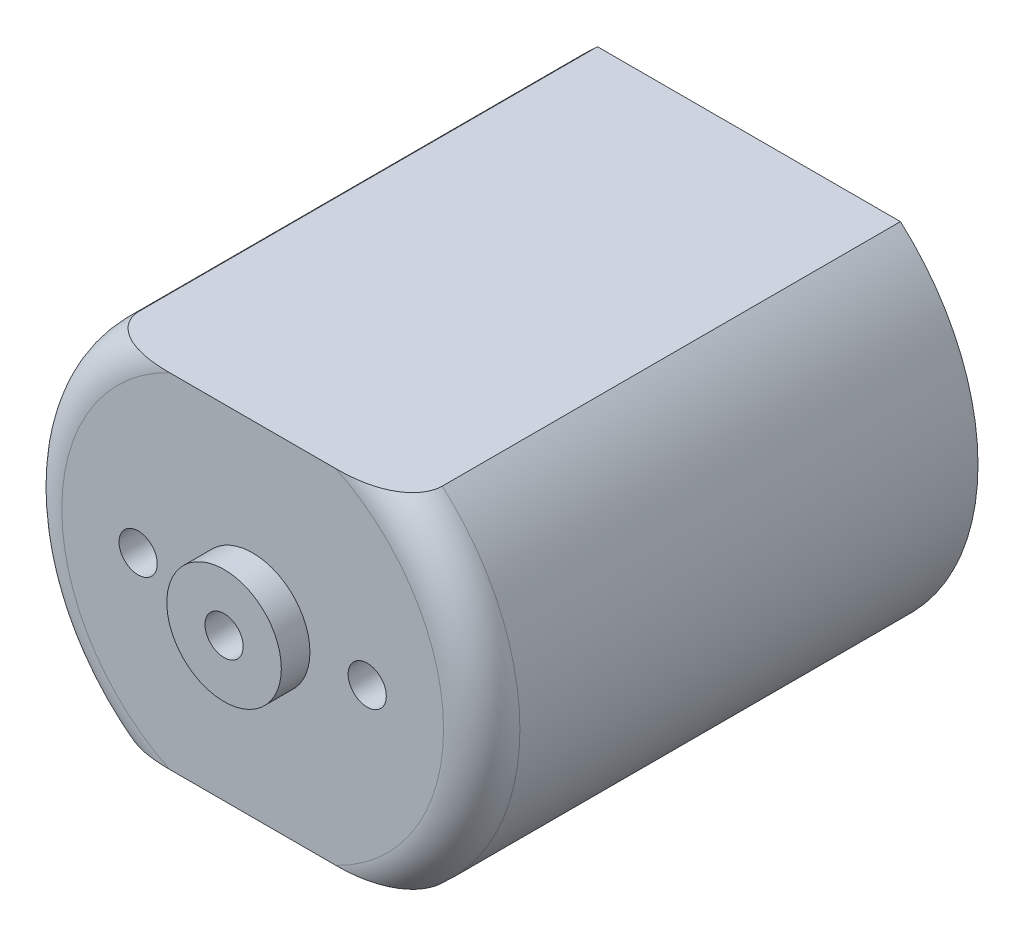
ISO-10303-21;
HEADER;
FILE_DESCRIPTION(('STEP AP214'),'2;1');
FILE_NAME('part.step','',(''),(''),'','','');
FILE_SCHEMA(('AUTOMOTIVE_DESIGN { 1 0 10303 214 1 1 1 1 }'));
ENDSEC;
DATA;
#1=APPLICATION_CONTEXT('core data for automotive mechanical design processes');
#2=APPLICATION_PROTOCOL_DEFINITION('international standard','automotive_design',2000,#1);
#3=PRODUCT_CONTEXT('',#1,'mechanical');
#4=PRODUCT('Part','Part','',(#3));
#5=PRODUCT_RELATED_PRODUCT_CATEGORY('part','',(#4));
#6=PRODUCT_DEFINITION_FORMATION('','',#4);
#7=PRODUCT_DEFINITION_CONTEXT('part definition',#1,'design');
#8=PRODUCT_DEFINITION('design','',#6,#7);
#9=PRODUCT_DEFINITION_SHAPE('','',#8);
#10=(LENGTH_UNIT() NAMED_UNIT(*) SI_UNIT(.MILLI.,.METRE.));
#11=(NAMED_UNIT(*) PLANE_ANGLE_UNIT() SI_UNIT($,.RADIAN.));
#12=(NAMED_UNIT(*) SI_UNIT($,.STERADIAN.) SOLID_ANGLE_UNIT());
#13=UNCERTAINTY_MEASURE_WITH_UNIT(LENGTH_MEASURE(1.E-05),#10,'distance_accuracy_value','');
#14=(GEOMETRIC_REPRESENTATION_CONTEXT(3) GLOBAL_UNCERTAINTY_ASSIGNED_CONTEXT((#13)) GLOBAL_UNIT_ASSIGNED_CONTEXT((#10,
#11,#12)) REPRESENTATION_CONTEXT('',''));
#15=CARTESIAN_POINT('',(0.,0.,0.));
#16=DIRECTION('',(0.,0.,1.));
#17=DIRECTION('',(1.,0.,0.));
#18=AXIS2_PLACEMENT_3D('',#15,#16,#17);
#19=CARTESIAN_POINT('',(0.,0.,-13.));
#20=DIRECTION('',(0.,0.,1.));
#21=DIRECTION('',(1.,0.,0.));
#22=AXIS2_PLACEMENT_3D('',#19,#20,#21);
#23=PLANE('',#22);
#24=DIRECTION('',(1.,0.,0.));
#25=VECTOR('',#24,1.);
#26=CARTESIAN_POINT('',(12.0000000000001,9.00000000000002,-13.));
#27=LINE('',#26,#25);
#28=CARTESIAN_POINT('',(-7.93725393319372,9.00000000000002,-13.));
#29=VERTEX_POINT('',#28);
#30=CARTESIAN_POINT('',(7.93725393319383,9.00000000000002,-13.));
#31=VERTEX_POINT('',#30);
#32=EDGE_CURVE('E93',#29,#31,#27,.T.);
#33=ORIENTED_EDGE('',*,*,#32,.T.);
#34=CARTESIAN_POINT('',(0.,0.,-13.));
#35=DIRECTION('',(0.,0.,1.));
#36=DIRECTION('',(1.,0.,0.));
#37=AXIS2_PLACEMENT_3D('',#34,#35,#36);
#38=CIRCLE('',#37,12.);
#39=CARTESIAN_POINT('',(7.93725393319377,-9.00000000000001,-13.));
#40=VERTEX_POINT('',#39);
#41=EDGE_CURVE('E88',#40,#31,#38,.T.);
#42=ORIENTED_EDGE('',*,*,#41,.F.);
#43=DIRECTION('',(-1.,0.,0.));
#44=VECTOR('',#43,1.);
#45=CARTESIAN_POINT('',(12.,-9.00000000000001,-13.));
#46=LINE('',#45,#44);
#47=CARTESIAN_POINT('',(-7.93725393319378,-9.00000000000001,-13.));
#48=VERTEX_POINT('',#47);
#49=EDGE_CURVE('E92',#40,#48,#46,.T.);
#50=ORIENTED_EDGE('',*,*,#49,.T.);
#51=EDGE_CURVE('E98',#29,#48,#38,.T.);
#52=ORIENTED_EDGE('',*,*,#51,.F.);
#53=EDGE_LOOP('',(#33,#42,#50,#52));
#54=FACE_BOUND('',#53,.T.);
#55=CARTESIAN_POINT('',(0.,0.,-13.));
#56=DIRECTION('',(0.,0.,1.));
#57=DIRECTION('',(1.,0.,0.));
#58=AXIS2_PLACEMENT_3D('',#55,#56,#57);
#59=CIRCLE('',#58,3.);
#60=CARTESIAN_POINT('',(3.,0.,-13.));
#61=VERTEX_POINT('',#60);
#62=EDGE_CURVE('E11',#61,#61,#59,.F.);
#63=ORIENTED_EDGE('',*,*,#62,.F.);
#64=EDGE_LOOP('',(#63));
#65=FACE_BOUND('',#64,.T.);
#66=ADVANCED_FACE('F33',(#54,#65),#23,.F.);
#67=CARTESIAN_POINT('',(0.,0.,13.));
#68=DIRECTION('',(0.,0.,1.));
#69=DIRECTION('',(1.,0.,0.));
#70=AXIS2_PLACEMENT_3D('',#67,#68,#69);
#71=PLANE('',#70);
#72=CARTESIAN_POINT('',(-6.00000000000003,0.,13.));
#73=DIRECTION('',(0.,0.,1.));
#74=DIRECTION('',(-1.,0.,0.));
#75=AXIS2_PLACEMENT_3D('',#72,#73,#74);
#76=CIRCLE('',#75,1.);
#77=CARTESIAN_POINT('',(-7.00000000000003,0.,13.));
#78=VERTEX_POINT('',#77);
#79=EDGE_CURVE('E199',#78,#78,#76,.T.);
#80=ORIENTED_EDGE('',*,*,#79,.F.);
#81=EDGE_LOOP('',(#80));
#82=FACE_BOUND('',#81,.T.);
#83=CARTESIAN_POINT('',(5.99999999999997,0.,13.));
#84=DIRECTION('',(0.,0.,1.));
#85=DIRECTION('',(1.,0.,0.));
#86=AXIS2_PLACEMENT_3D('',#83,#84,#85);
#87=CIRCLE('',#86,1.);
#88=CARTESIAN_POINT('',(6.99999999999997,0.,13.));
#89=VERTEX_POINT('',#88);
#90=EDGE_CURVE('E203',#89,#89,#87,.T.);
#91=ORIENTED_EDGE('',*,*,#90,.F.);
#92=EDGE_LOOP('',(#91));
#93=FACE_BOUND('',#92,.T.);
#94=CARTESIAN_POINT('',(0.,0.,13.));
#95=DIRECTION('',(0.,0.,1.));
#96=DIRECTION('',(1.,0.,0.));
#97=AXIS2_PLACEMENT_3D('',#94,#95,#96);
#98=CIRCLE('',#97,10.);
#99=CARTESIAN_POINT('',(4.35889894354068,-9.00000000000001,13.));
#100=VERTEX_POINT('',#99);
#101=CARTESIAN_POINT('',(4.35889894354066,8.99999999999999,13.));
#102=VERTEX_POINT('',#101);
#103=EDGE_CURVE('E97',#100,#102,#98,.T.);
#104=ORIENTED_EDGE('',*,*,#103,.T.);
#105=DIRECTION('',(1.,0.,0.));
#106=VECTOR('',#105,1.);
#107=CARTESIAN_POINT('',(12.0000000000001,8.99999999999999,13.));
#108=LINE('',#107,#106);
#109=CARTESIAN_POINT('',(-4.3588989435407,8.99999999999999,13.));
#110=VERTEX_POINT('',#109);
#111=EDGE_CURVE('E56',#110,#102,#108,.T.);
#112=ORIENTED_EDGE('',*,*,#111,.F.);
#113=CARTESIAN_POINT('',(-4.35889894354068,-9.00000000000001,13.));
#114=VERTEX_POINT('',#113);
#115=EDGE_CURVE('E121',#110,#114,#98,.T.);
#116=ORIENTED_EDGE('',*,*,#115,.T.);
#117=DIRECTION('',(-1.,0.,0.));
#118=VECTOR('',#117,1.);
#119=CARTESIAN_POINT('',(12.,-9.00000000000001,13.));
#120=LINE('',#119,#118);
#121=EDGE_CURVE('E48',#100,#114,#120,.T.);
#122=ORIENTED_EDGE('',*,*,#121,.F.);
#123=EDGE_LOOP('',(#104,#112,#116,#122));
#124=FACE_BOUND('',#123,.T.);
#125=CARTESIAN_POINT('',(0.,0.,13.));
#126=DIRECTION('',(0.,0.,1.));
#127=DIRECTION('',(1.,0.,0.));
#128=AXIS2_PLACEMENT_3D('',#125,#126,#127);
#129=CIRCLE('',#128,3.);
#130=CARTESIAN_POINT('',(3.,0.,13.));
#131=VERTEX_POINT('',#130);
#132=EDGE_CURVE('E208',#131,#131,#129,.T.);
#133=ORIENTED_EDGE('',*,*,#132,.F.);
#134=EDGE_LOOP('',(#133));
#135=FACE_BOUND('',#134,.T.);
#136=ADVANCED_FACE('F187',(#82,#93,#124,#135),#71,.T.);
#137=CARTESIAN_POINT('',(0.,0.,13.));
#138=DIRECTION('',(0.,0.,-1.));
#139=DIRECTION('',(-1.,0.,0.));
#140=AXIS2_PLACEMENT_3D('',#137,#138,#139);
#141=CYLINDRICAL_SURFACE('',#140,12.);
#142=DIRECTION('',(0.,0.,-1.));
#143=VECTOR('',#142,1.);
#144=CARTESIAN_POINT('',(7.93725393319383,8.99999999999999,13.));
#145=LINE('',#144,#143);
#146=CARTESIAN_POINT('',(7.93725393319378,8.99999999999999,11.));
#147=VERTEX_POINT('',#146);
#148=EDGE_CURVE('E110',#147,#31,#145,.T.);
#149=ORIENTED_EDGE('',*,*,#148,.F.);
#150=CARTESIAN_POINT('',(0.,0.,11.));
#151=DIRECTION('',(0.,0.,1.));
#152=DIRECTION('',(1.,0.,0.));
#153=AXIS2_PLACEMENT_3D('',#150,#151,#152);
#154=CIRCLE('',#153,12.);
#155=CARTESIAN_POINT('',(7.93725393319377,-9.00000000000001,11.));
#156=VERTEX_POINT('',#155);
#157=EDGE_CURVE('E109',#147,#156,#154,.F.);
#158=ORIENTED_EDGE('',*,*,#157,.T.);
#159=DIRECTION('',(0.,0.,-1.));
#160=VECTOR('',#159,1.);
#161=CARTESIAN_POINT('',(7.93725393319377,-9.00000000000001,13.));
#162=LINE('',#161,#160);
#163=EDGE_CURVE('E102',#40,#156,#162,.F.);
#164=ORIENTED_EDGE('',*,*,#163,.F.);
#165=ORIENTED_EDGE('',*,*,#41,.T.);
#166=EDGE_LOOP('',(#149,#158,#164,#165));
#167=FACE_BOUND('',#166,.T.);
#168=ADVANCED_FACE('F35',(#167),#141,.T.);
#169=CARTESIAN_POINT('',(-7.93725393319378,-9.00000000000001,11.));
#170=VERTEX_POINT('',#169);
#171=CARTESIAN_POINT('',(-7.93725393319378,9.00000000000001,11.));
#172=VERTEX_POINT('',#171);
#173=EDGE_CURVE('E124',#170,#172,#154,.F.);
#174=ORIENTED_EDGE('',*,*,#173,.T.);
#175=DIRECTION('',(0.,0.,-1.));
#176=VECTOR('',#175,1.);
#177=CARTESIAN_POINT('',(-7.93725393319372,8.99999999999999,13.));
#178=LINE('',#177,#176);
#179=EDGE_CURVE('E112',#29,#172,#178,.F.);
#180=ORIENTED_EDGE('',*,*,#179,.F.);
#181=ORIENTED_EDGE('',*,*,#51,.T.);
#182=DIRECTION('',(0.,0.,-1.));
#183=VECTOR('',#182,1.);
#184=CARTESIAN_POINT('',(-7.93725393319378,-8.99999999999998,13.));
#185=LINE('',#184,#183);
#186=EDGE_CURVE('E105',#170,#48,#185,.T.);
#187=ORIENTED_EDGE('',*,*,#186,.F.);
#188=EDGE_LOOP('',(#174,#180,#181,#187));
#189=FACE_BOUND('',#188,.T.);
#190=ADVANCED_FACE('F195',(#189),#141,.T.);
#191=CARTESIAN_POINT('',(0.,0.,11.));
#192=DIRECTION('',(0.,0.,1.));
#193=DIRECTION('',(1.,0.,0.));
#194=AXIS2_PLACEMENT_3D('',#191,#192,#193);
#195=TOROIDAL_SURFACE('',#194,10.,2.);
#196=ORIENTED_EDGE('',*,*,#115,.F.);
#197=CARTESIAN_POINT('',(0.,8.99999999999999,12.7320508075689));
#198=CARTESIAN_POINT('',(-0.166446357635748,8.99999999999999,12.732053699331));
#199=CARTESIAN_POINT('',(-0.332895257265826,9.,12.734745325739));
#200=CARTESIAN_POINT('',(-0.665633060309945,9.,12.74518762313));
#201=CARTESIAN_POINT('',(-0.831921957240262,9.,12.7529384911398));
#202=CARTESIAN_POINT('',(-1.1644046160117,9.,12.7725798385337));
#203=CARTESIAN_POINT('',(-1.33059813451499,9.,12.7844742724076));
#204=CARTESIAN_POINT('',(-1.66276754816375,9.,12.8110347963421));
#205=CARTESIAN_POINT('',(-1.82874342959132,9.,12.8257010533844));
#206=CARTESIAN_POINT('',(-2.32866263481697,9.,12.8716350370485));
#207=CARTESIAN_POINT('',(-2.66242295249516,9.,12.9046688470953));
#208=CARTESIAN_POINT('',(-3.33063349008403,9.,12.960836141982));
#209=CARTESIAN_POINT('',(-3.66508260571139,8.99999999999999,12.9839800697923));
#210=CARTESIAN_POINT('',(-4.16865262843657,8.99999999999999,12.9994679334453));
#211=CARTESIAN_POINT('',(-4.33742400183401,9.,13.0013982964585));
#212=CARTESIAN_POINT('',(-4.67497029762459,9.,12.996483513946));
#213=CARTESIAN_POINT('',(-4.84374517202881,9.,12.9896335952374));
#214=CARTESIAN_POINT('',(-5.17956621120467,8.99999999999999,12.9647163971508));
#215=CARTESIAN_POINT('',(-5.3466167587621,8.99999999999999,12.9467125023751));
#216=CARTESIAN_POINT('',(-5.67854136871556,9.,12.89672313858));
#217=CARTESIAN_POINT('',(-5.84341751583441,9.00000000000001,12.8647522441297));
#218=CARTESIAN_POINT('',(-6.15040270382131,9.00000000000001,12.7881418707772));
#219=CARTESIAN_POINT('',(-6.29296508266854,9.,12.7453612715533));
#220=CARTESIAN_POINT('',(-6.57260930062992,9.,12.643394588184));
#221=CARTESIAN_POINT('',(-6.70967893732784,9.00000000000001,12.5841740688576));
#222=CARTESIAN_POINT('',(-6.97572844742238,9.00000000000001,12.4454900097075));
#223=CARTESIAN_POINT('',(-7.10457682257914,9.,12.365768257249));
#224=CARTESIAN_POINT('',(-7.34506582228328,9.,12.1836397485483));
#225=CARTESIAN_POINT('',(-7.45677759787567,9.00000000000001,12.0813313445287));
#226=CARTESIAN_POINT('',(-7.61173645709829,9.00000000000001,11.9010388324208));
#227=CARTESIAN_POINT('',(-7.66405220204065,9.,11.8308383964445));
#228=CARTESIAN_POINT('',(-7.75695431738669,9.,11.68298457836));
#229=CARTESIAN_POINT('',(-7.79754679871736,9.00000000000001,11.6053351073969));
#230=CARTESIAN_POINT('',(-7.86464739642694,9.00000000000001,11.4433000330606));
#231=CARTESIAN_POINT('',(-7.89103215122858,9.,11.3588625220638));
#232=CARTESIAN_POINT('',(-7.92695436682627,9.,11.186470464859));
#233=CARTESIAN_POINT('',(-7.93650581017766,9.00000000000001,11.0985188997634));
#234=CARTESIAN_POINT('',(-7.93783287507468,9.00000000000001,10.9331765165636));
#235=CARTESIAN_POINT('',(-7.93161940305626,9.,10.8557954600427));
#236=CARTESIAN_POINT('',(-7.90600892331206,9.,10.7032665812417));
#237=CARTESIAN_POINT('',(-7.88661169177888,9.00000000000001,10.6281187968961));
#238=CARTESIAN_POINT('',(-7.83637641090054,9.00000000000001,10.4832771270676));
#239=CARTESIAN_POINT('',(-7.805743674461,9.,10.4135110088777));
#240=CARTESIAN_POINT('',(-7.73468118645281,9.,10.2792046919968));
#241=CARTESIAN_POINT('',(-7.69424752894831,9.00000000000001,10.2146665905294));
#242=CARTESIAN_POINT('',(-7.58437112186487,9.00000000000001,10.0624487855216));
#243=CARTESIAN_POINT('',(-7.51022785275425,9.,9.97815715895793));
#244=CARTESIAN_POINT('',(-7.3493877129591,9.,9.82255305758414));
#245=CARTESIAN_POINT('',(-7.26266234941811,9.00000000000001,9.75127089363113));
#246=CARTESIAN_POINT('',(-7.03603261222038,9.00000000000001,9.58917904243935));
#247=CARTESIAN_POINT('',(-6.89083196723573,9.,9.50581846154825));
#248=CARTESIAN_POINT('',(-6.58954981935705,9.,9.36229888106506));
#249=CARTESIAN_POINT('',(-6.43344899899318,9.00000000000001,9.30218237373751));
#250=CARTESIAN_POINT('',(-6.1342245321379,9.00000000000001,9.20713223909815));
#251=CARTESIAN_POINT('',(-5.99176040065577,9.,9.17005620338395));
#252=CARTESIAN_POINT('',(-5.70410355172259,8.99999999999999,9.10830900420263));
#253=CARTESIAN_POINT('',(-5.5589085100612,8.99999999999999,9.08364895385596));
#254=CARTESIAN_POINT('',(-5.26689906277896,9.,9.04458852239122));
#255=CARTESIAN_POINT('',(-5.12008198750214,9.,9.03020887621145));
#256=CARTESIAN_POINT('',(-4.82584012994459,9.,9.00990272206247));
#257=CARTESIAN_POINT('',(-4.67841512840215,8.99999999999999,9.00397959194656));
#258=CARTESIAN_POINT('',(-4.36286529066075,8.99999999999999,8.99857006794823));
#259=CARTESIAN_POINT('',(-4.1947263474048,9.,9.00009867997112));
#260=CARTESIAN_POINT('',(-3.85867645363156,9.,9.00975093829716));
#261=CARTESIAN_POINT('',(-3.69076549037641,9.,9.01787419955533));
#262=CARTESIAN_POINT('',(-3.18698001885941,9.,9.04906777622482));
#263=CARTESIAN_POINT('',(-2.85156732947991,9.,9.07895783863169));
#264=CARTESIAN_POINT('',(-2.34926697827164,9.,9.12583525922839));
#265=CARTESIAN_POINT('',(-2.18223841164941,9.,9.14177414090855));
#266=CARTESIAN_POINT('',(-1.84808185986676,9.,9.17256166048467));
#267=CARTESIAN_POINT('',(-1.68095388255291,9.,9.18741037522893));
#268=CARTESIAN_POINT('',(-1.34667924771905,9.,9.21433036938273));
#269=CARTESIAN_POINT('',(-1.17953287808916,9.,9.22640511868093));
#270=CARTESIAN_POINT('',(-0.84498772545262,9.,9.24640094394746));
#271=CARTESIAN_POINT('',(-0.677588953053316,8.99999999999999,9.25432218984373));
#272=CARTESIAN_POINT('',(-0.353673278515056,8.99999999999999,9.26470293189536));
#273=CARTESIAN_POINT('',(-0.197167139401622,9.,9.26748831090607));
#274=CARTESIAN_POINT('',(0.115858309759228,9.,9.26830405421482));
#275=CARTESIAN_POINT('',(0.272377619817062,9.,9.26633441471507));
#276=CARTESIAN_POINT('',(0.585397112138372,9.,9.25785065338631));
#277=CARTESIAN_POINT('',(0.7418972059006,9.,9.25133338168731));
#278=CARTESIAN_POINT('',(1.05468513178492,9.,9.2344459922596));
#279=CARTESIAN_POINT('',(1.21097295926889,9.,9.22407579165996));
#280=CARTESIAN_POINT('',(1.52404825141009,9.,9.20049108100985));
#281=CARTESIAN_POINT('',(1.68083471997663,9.,9.18726374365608));
#282=CARTESIAN_POINT('',(1.99427604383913,9.,9.15931406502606));
#283=CARTESIAN_POINT('',(2.15093089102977,9.,9.14459163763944));
#284=CARTESIAN_POINT('',(2.62080244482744,9.,9.10035040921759));
#285=CARTESIAN_POINT('',(2.93402711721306,8.99999999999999,9.07074822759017));
#286=CARTESIAN_POINT('',(3.42170521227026,8.99999999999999,9.03414088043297));
#287=CARTESIAN_POINT('',(3.59581946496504,9.,9.0229437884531));
#288=CARTESIAN_POINT('',(3.9443894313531,9.,9.00650713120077));
#289=CARTESIAN_POINT('',(4.11884521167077,9.,9.00126887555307));
#290=CARTESIAN_POINT('',(4.46738478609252,9.,8.99913723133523));
#291=CARTESIAN_POINT('',(4.64146831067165,9.,9.00222131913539));
#292=CARTESIAN_POINT('',(4.98903608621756,9.,9.01929967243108));
#293=CARTESIAN_POINT('',(5.16252059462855,8.99999999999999,9.03328844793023));
#294=CARTESIAN_POINT('',(5.54190186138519,8.99999999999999,9.07926776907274));
#295=CARTESIAN_POINT('',(5.74748282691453,9.,9.11425067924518));
#296=CARTESIAN_POINT('',(6.05126087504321,9.,9.18618675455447));
#297=CARTESIAN_POINT('',(6.15177097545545,8.99999999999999,9.21341520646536));
#298=CARTESIAN_POINT('',(6.35047200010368,8.99999999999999,9.27526323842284));
#299=CARTESIAN_POINT('',(6.44866381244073,8.99999999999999,9.30987993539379));
#300=CARTESIAN_POINT('',(6.67760627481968,8.99999999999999,9.4018810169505));
#301=CARTESIAN_POINT('',(6.80691977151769,8.99999999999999,9.46294744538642));
#302=CARTESIAN_POINT('',(7.0552378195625,8.99999999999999,9.60340858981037));
#303=CARTESIAN_POINT('',(7.17425968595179,8.99999999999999,9.68277166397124));
#304=CARTESIAN_POINT('',(7.36455614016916,8.99999999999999,9.83676673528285));
#305=CARTESIAN_POINT('',(7.43983151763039,8.99999999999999,9.90642400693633));
#306=CARTESIAN_POINT('',(7.57858868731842,8.99999999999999,10.0566961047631));
#307=CARTESIAN_POINT('',(7.64208598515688,8.99999999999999,10.1372962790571));
#308=CARTESIAN_POINT('',(7.74268923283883,8.99999999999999,10.292396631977));
#309=CARTESIAN_POINT('',(7.78251961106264,8.99999999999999,10.365120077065));
#310=CARTESIAN_POINT('',(7.84961901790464,8.99999999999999,10.516186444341));
#311=CARTESIAN_POINT('',(7.87689566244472,8.99999999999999,10.5945259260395));
#312=CARTESIAN_POINT('',(7.91708780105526,8.99999999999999,10.75535309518));
#313=CARTESIAN_POINT('',(7.92991762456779,8.99999999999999,10.8378625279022));
#314=CARTESIAN_POINT('',(7.93985142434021,8.99999999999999,11.0038227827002));
#315=CARTESIAN_POINT('',(7.93696010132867,8.99999999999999,11.0872733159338));
#316=CARTESIAN_POINT('',(7.91675510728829,8.99999999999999,11.2441717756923));
#317=CARTESIAN_POINT('',(7.90085846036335,8.99999999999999,11.3178085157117));
#318=CARTESIAN_POINT('',(7.85750648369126,8.99999999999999,11.4615660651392));
#319=CARTESIAN_POINT('',(7.83004970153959,8.99999999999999,11.5316864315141));
#320=CARTESIAN_POINT('',(7.76345524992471,8.99999999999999,11.6705117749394));
#321=CARTESIAN_POINT('',(7.72379465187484,8.99999999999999,11.7389635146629));
#322=CARTESIAN_POINT('',(7.63536443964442,8.99999999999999,11.8696579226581));
#323=CARTESIAN_POINT('',(7.586590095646,8.99999999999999,11.9318973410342));
#324=CARTESIAN_POINT('',(7.45132066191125,8.99999999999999,12.0841256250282));
#325=CARTESIAN_POINT('',(7.35935887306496,8.99999999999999,12.1692632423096));
#326=CARTESIAN_POINT('',(7.16308212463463,8.99999999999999,12.3239343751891));
#327=CARTESIAN_POINT('',(7.05873445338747,8.99999999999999,12.3934251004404));
#328=CARTESIAN_POINT('',(6.86609382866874,8.99999999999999,12.5043343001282));
#329=CARTESIAN_POINT('',(6.77938111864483,8.99999999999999,12.5485598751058));
#330=CARTESIAN_POINT('',(6.60240448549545,8.99999999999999,12.6292764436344));
#331=CARTESIAN_POINT('',(6.51213846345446,8.99999999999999,12.6657627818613));
#332=CARTESIAN_POINT('',(6.23757633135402,8.99999999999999,12.7648516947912));
#333=CARTESIAN_POINT('',(6.04950792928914,8.99999999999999,12.8170886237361));
#334=CARTESIAN_POINT('',(5.74565389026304,8.99999999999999,12.8830249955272));
#335=CARTESIAN_POINT('',(5.63123819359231,9.,12.9037732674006));
#336=CARTESIAN_POINT('',(5.40137538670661,9.,12.9385371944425));
#337=CARTESIAN_POINT('',(5.28592827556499,9.,12.9525528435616));
#338=CARTESIAN_POINT('',(4.93843430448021,9.,12.9860039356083));
#339=CARTESIAN_POINT('',(4.70556611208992,9.,12.9967780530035));
#340=CARTESIAN_POINT('',(4.23822330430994,9.,13.0019833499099));
#341=CARTESIAN_POINT('',(4.0037488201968,9.,12.9962999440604));
#342=CARTESIAN_POINT('',(3.53553173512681,9.,12.9742053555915));
#343=CARTESIAN_POINT('',(3.30178874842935,8.99999999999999,12.9578013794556));
#344=CARTESIAN_POINT('',(2.81177504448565,8.99999999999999,12.9177246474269));
#345=CARTESIAN_POINT('',(2.55555472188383,9.,12.8934948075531));
#346=CARTESIAN_POINT('',(2.0430177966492,9.,12.8452592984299));
#347=CARTESIAN_POINT('',(1.78670118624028,9.,12.8212536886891));
#348=CARTESIAN_POINT('',(1.40282309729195,9.,12.7901242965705));
#349=CARTESIAN_POINT('',(1.27546559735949,9.,12.7805892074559));
#350=CARTESIAN_POINT('',(1.02060683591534,9.,12.7637211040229));
#351=CARTESIAN_POINT('',(0.893105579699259,9.,12.7563880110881));
#352=CARTESIAN_POINT('',(0.638039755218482,9.,12.744439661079));
#353=CARTESIAN_POINT('',(0.510475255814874,9.,12.7398229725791));
#354=CARTESIAN_POINT('',(0.255274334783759,9.,12.7336274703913));
#355=CARTESIAN_POINT('',(0.127637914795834,8.99999999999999,12.7320485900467));
#356=CARTESIAN_POINT('',(0.,8.99999999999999,12.7320508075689));
#357=B_SPLINE_CURVE_WITH_KNOTS('',3,(#197,#198,#199,#200,#201,#202,#203,#204,#205,#206,#207,
#208,#209,#210,#211,#212,#213,#214,#215,#216,#217,#218,#219,#220,#221,#222,#223,#224,#225,#226,
#227,#228,#229,#230,#231,#232,#233,#234,#235,#236,#237,#238,#239,#240,#241,#242,#243,#244,#245,
#246,#247,#248,#249,#250,#251,#252,#253,#254,#255,#256,#257,#258,#259,#260,#261,#262,#263,#264,
#265,#266,#267,#268,#269,#270,#271,#272,#273,#274,#275,#276,#277,#278,#279,#280,#281,#282,#283,
#284,#285,#286,#287,#288,#289,#290,#291,#292,#293,#294,#295,#296,#297,#298,#299,#300,#301,#302,
#303,#304,#305,#306,#307,#308,#309,#310,#311,#312,#313,#314,#315,#316,#317,#318,#319,#320,#321,
#322,#323,#324,#325,#326,#327,#328,#329,#330,#331,#332,#333,#334,#335,#336,#337,#338,#339,#340,
#341,#342,#343,#344,#345,#346,#347,#348,#349,#350,#351,#352,#353,#354,#355,#356),.UNSPECIFIED.,
.T.,.F.,(4,2,2,2,2,2,2,2,2,2,2,2,2,2,2,2,2,2,2,2,2,2,2,2,2,2,2,2,2,2,2,2,2,2,2,2,2,2,2,2,2,2,2,
2,2,2,2,2,2,2,2,2,2,2,2,2,2,2,2,2,2,2,2,2,2,2,2,2,2,2,2,2,2,2,2,2,2,2,2,4),(0.,
0.499323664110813,0.998666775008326,1.49848775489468,1.99833885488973,3.00458283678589,
4.00976165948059,4.5159343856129,5.02238239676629,5.52597848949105,6.02905033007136,
6.47479297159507,6.92147640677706,7.37408771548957,7.82476572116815,8.08650557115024,
8.3481087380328,8.61194813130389,8.87556826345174,9.10729249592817,9.33902066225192,
9.56670968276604,9.79448959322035,10.1293755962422,10.4650321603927,10.964510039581,
11.4648967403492,11.9058772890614,12.3472518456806,12.7895141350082,13.2319530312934,
13.7362114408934,14.2404404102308,15.250438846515,15.7538187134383,16.2571630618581,
16.7598743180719,17.2625650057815,17.732088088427,18.2016115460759,18.6714605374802,
19.1413196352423,19.6133337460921,20.0853750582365,21.0291534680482,21.5525056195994,
22.0759727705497,22.5980246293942,23.1198138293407,23.7439325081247,24.0560955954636,
24.3681370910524,24.7959557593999,25.2230400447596,25.529711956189,25.8359772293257,
26.0837277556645,26.3313277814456,26.5803884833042,26.8293747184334,27.0543613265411,
27.2793762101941,27.5158318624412,27.7524105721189,28.1262506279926,28.5011009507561,
28.792713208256,29.0845003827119,29.6680469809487,30.0167492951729,30.3654519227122,
31.0638650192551,31.7671524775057,32.4699676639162,33.2420562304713,34.0143441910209,
34.3974702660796,34.780582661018,35.1634929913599,35.5463949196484),.UNSPECIFIED.);
#358=EDGE_CURVE('E41',#110,#172,#357,.T.);
#359=ORIENTED_EDGE('',*,*,#358,.T.);
#360=ORIENTED_EDGE('',*,*,#173,.F.);
#361=CARTESIAN_POINT('',(0.,-9.00000000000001,12.7320508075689));
#362=CARTESIAN_POINT('',(0.166446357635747,-9.00000000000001,12.732053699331));
#363=CARTESIAN_POINT('',(0.332895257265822,-9.00000000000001,12.734745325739));
#364=CARTESIAN_POINT('',(0.665633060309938,-9.00000000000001,12.74518762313));
#365=CARTESIAN_POINT('',(0.831921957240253,-9.00000000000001,12.7529384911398));
#366=CARTESIAN_POINT('',(1.16440461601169,-9.00000000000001,12.7725798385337));
#367=CARTESIAN_POINT('',(1.33059813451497,-9.00000000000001,12.7844742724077));
#368=CARTESIAN_POINT('',(1.66276754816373,-9.00000000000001,12.8110347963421));
#369=CARTESIAN_POINT('',(1.8287434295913,-9.00000000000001,12.8257010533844));
#370=CARTESIAN_POINT('',(2.32866263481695,-9.00000000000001,12.8716350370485));
#371=CARTESIAN_POINT('',(2.66242295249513,-9.00000000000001,12.9046688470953));
#372=CARTESIAN_POINT('',(3.330633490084,-9.00000000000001,12.960836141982));
#373=CARTESIAN_POINT('',(3.66508260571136,-9.00000000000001,12.9839800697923));
#374=CARTESIAN_POINT('',(4.16865262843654,-9.00000000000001,12.9994679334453));
#375=CARTESIAN_POINT('',(4.33742400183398,-9.00000000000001,13.0013982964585));
#376=CARTESIAN_POINT('',(4.67497029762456,-9.00000000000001,12.996483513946));
#377=CARTESIAN_POINT('',(4.84374517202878,-9.00000000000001,12.9896335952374));
#378=CARTESIAN_POINT('',(5.17956621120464,-9.00000000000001,12.9647163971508));
#379=CARTESIAN_POINT('',(5.34661675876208,-9.00000000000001,12.9467125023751));
#380=CARTESIAN_POINT('',(5.67854136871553,-9.00000000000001,12.89672313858));
#381=CARTESIAN_POINT('',(5.84341751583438,-9.00000000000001,12.8647522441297));
#382=CARTESIAN_POINT('',(6.15040270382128,-9.00000000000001,12.7881418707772));
#383=CARTESIAN_POINT('',(6.29296508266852,-9.00000000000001,12.7453612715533));
#384=CARTESIAN_POINT('',(6.5726093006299,-9.00000000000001,12.643394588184));
#385=CARTESIAN_POINT('',(6.70967893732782,-9.00000000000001,12.5841740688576));
#386=CARTESIAN_POINT('',(6.97572844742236,-9.00000000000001,12.4454900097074));
#387=CARTESIAN_POINT('',(7.10457682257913,-9.00000000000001,12.365768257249));
#388=CARTESIAN_POINT('',(7.34506582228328,-9.00000000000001,12.1836397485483));
#389=CARTESIAN_POINT('',(7.45677759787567,-9.00000000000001,12.0813313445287));
#390=CARTESIAN_POINT('',(7.61173645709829,-9.00000000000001,11.9010388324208));
#391=CARTESIAN_POINT('',(7.66405220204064,-9.00000000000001,11.8308383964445));
#392=CARTESIAN_POINT('',(7.75695431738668,-9.00000000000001,11.68298457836));
#393=CARTESIAN_POINT('',(7.79754679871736,-9.00000000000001,11.6053351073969));
#394=CARTESIAN_POINT('',(7.86464739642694,-9.00000000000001,11.4433000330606));
#395=CARTESIAN_POINT('',(7.89103215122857,-9.00000000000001,11.3588625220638));
#396=CARTESIAN_POINT('',(7.92695436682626,-9.00000000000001,11.186470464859));
#397=CARTESIAN_POINT('',(7.93650581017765,-9.00000000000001,11.0985188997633));
#398=CARTESIAN_POINT('',(7.93783287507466,-9.00000000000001,10.9331765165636));
#399=CARTESIAN_POINT('',(7.93161940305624,-9.00000000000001,10.8557954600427));
#400=CARTESIAN_POINT('',(7.90600892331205,-9.00000000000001,10.7032665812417));
#401=CARTESIAN_POINT('',(7.88661169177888,-9.00000000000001,10.6281187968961));
#402=CARTESIAN_POINT('',(7.83637641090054,-9.00000000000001,10.4832771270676));
#403=CARTESIAN_POINT('',(7.80574367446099,-9.00000000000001,10.4135110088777));
#404=CARTESIAN_POINT('',(7.7346811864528,-9.00000000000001,10.2792046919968));
#405=CARTESIAN_POINT('',(7.69424752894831,-9.00000000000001,10.2146665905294));
#406=CARTESIAN_POINT('',(7.58437112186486,-9.00000000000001,10.0624487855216));
#407=CARTESIAN_POINT('',(7.51022785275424,-9.00000000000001,9.97815715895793));
#408=CARTESIAN_POINT('',(7.34938771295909,-9.00000000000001,9.82255305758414));
#409=CARTESIAN_POINT('',(7.2626623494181,-9.00000000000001,9.75127089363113));
#410=CARTESIAN_POINT('',(7.03603261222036,-9.00000000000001,9.58917904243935));
#411=CARTESIAN_POINT('',(6.89083196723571,-9.00000000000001,9.50581846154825));
#412=CARTESIAN_POINT('',(6.58954981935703,-9.00000000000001,9.36229888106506));
#413=CARTESIAN_POINT('',(6.43344899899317,-9.00000000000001,9.3021823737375));
#414=CARTESIAN_POINT('',(6.13422453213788,-9.00000000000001,9.20713223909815));
#415=CARTESIAN_POINT('',(5.99176040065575,-9.00000000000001,9.17005620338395));
#416=CARTESIAN_POINT('',(5.70410355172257,-9.00000000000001,9.10830900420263));
#417=CARTESIAN_POINT('',(5.55890851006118,-9.00000000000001,9.08364895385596));
#418=CARTESIAN_POINT('',(5.26689906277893,-9.00000000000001,9.04458852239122));
#419=CARTESIAN_POINT('',(5.12008198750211,-9.00000000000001,9.03020887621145));
#420=CARTESIAN_POINT('',(4.82584012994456,-9.00000000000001,9.00990272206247));
#421=CARTESIAN_POINT('',(4.67841512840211,-9.00000000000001,9.00397959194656));
#422=CARTESIAN_POINT('',(4.3628652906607,-9.00000000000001,8.99857006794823));
#423=CARTESIAN_POINT('',(4.19472634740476,-9.00000000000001,9.00009867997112));
#424=CARTESIAN_POINT('',(3.85867645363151,-9.00000000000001,9.00975093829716));
#425=CARTESIAN_POINT('',(3.69076549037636,-9.00000000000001,9.01787419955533));
#426=CARTESIAN_POINT('',(3.18698001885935,-9.00000000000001,9.04906777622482));
#427=CARTESIAN_POINT('',(2.85156732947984,-9.00000000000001,9.0789578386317));
#428=CARTESIAN_POINT('',(2.34926697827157,-9.00000000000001,9.12583525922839));
#429=CARTESIAN_POINT('',(2.18223841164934,-9.00000000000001,9.14177414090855));
#430=CARTESIAN_POINT('',(1.84808185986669,-9.00000000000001,9.17256166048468));
#431=CARTESIAN_POINT('',(1.68095388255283,-9.00000000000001,9.18741037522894));
#432=CARTESIAN_POINT('',(1.34667924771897,-9.00000000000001,9.21433036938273));
#433=CARTESIAN_POINT('',(1.17953287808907,-9.00000000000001,9.22640511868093));
#434=CARTESIAN_POINT('',(0.844987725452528,-9.00000000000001,9.24640094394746));
#435=CARTESIAN_POINT('',(0.677588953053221,-9.00000000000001,9.25432218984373));
#436=CARTESIAN_POINT('',(0.353673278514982,-9.00000000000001,9.26470293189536));
#437=CARTESIAN_POINT('',(0.197167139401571,-9.00000000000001,9.26748831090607));
#438=CARTESIAN_POINT('',(-0.115858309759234,-9.00000000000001,9.26830405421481));
#439=CARTESIAN_POINT('',(-0.272377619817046,-9.00000000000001,9.26633441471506));
#440=CARTESIAN_POINT('',(-0.585397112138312,-9.00000000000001,9.25785065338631));
#441=CARTESIAN_POINT('',(-0.741897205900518,-9.00000000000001,9.25133338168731));
#442=CARTESIAN_POINT('',(-1.05468513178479,-9.00000000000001,9.23444599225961));
#443=CARTESIAN_POINT('',(-1.21097295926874,-9.00000000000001,9.22407579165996));
#444=CARTESIAN_POINT('',(-1.5240482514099,-9.00000000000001,9.20049108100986));
#445=CARTESIAN_POINT('',(-1.68083471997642,-9.00000000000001,9.18726374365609));
#446=CARTESIAN_POINT('',(-1.99427604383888,-9.00000000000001,9.15931406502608));
#447=CARTESIAN_POINT('',(-2.1509308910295,-9.00000000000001,9.14459163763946));
#448=CARTESIAN_POINT('',(-2.62080244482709,-9.00000000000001,9.10035040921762));
#449=CARTESIAN_POINT('',(-2.93402711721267,-9.00000000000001,9.0707482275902));
#450=CARTESIAN_POINT('',(-3.4217052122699,-9.00000000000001,9.03414088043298));
#451=CARTESIAN_POINT('',(-3.59581946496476,-9.00000000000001,9.02294378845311));
#452=CARTESIAN_POINT('',(-3.94438943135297,-9.00000000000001,9.00650713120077));
#453=CARTESIAN_POINT('',(-4.11884521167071,-9.00000000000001,9.00126887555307));
#454=CARTESIAN_POINT('',(-4.4673847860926,-9.00000000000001,8.99913723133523));
#455=CARTESIAN_POINT('',(-4.64146831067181,-9.00000000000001,9.0022213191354));
#456=CARTESIAN_POINT('',(-4.98903608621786,-9.00000000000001,9.0192996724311));
#457=CARTESIAN_POINT('',(-5.16252059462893,-9.00000000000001,9.03328844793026));
#458=CARTESIAN_POINT('',(-5.54190186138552,-9.00000000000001,9.07926776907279));
#459=CARTESIAN_POINT('',(-5.74748282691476,-9.00000000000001,9.11425067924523));
#460=CARTESIAN_POINT('',(-6.05126087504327,-9.00000000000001,9.18618675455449));
#461=CARTESIAN_POINT('',(-6.15177097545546,-9.00000000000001,9.21341520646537));
#462=CARTESIAN_POINT('',(-6.35047200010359,-9.00000000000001,9.27526323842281));
#463=CARTESIAN_POINT('',(-6.44866381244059,-9.00000000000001,9.30987993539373));
#464=CARTESIAN_POINT('',(-6.67760627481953,-9.00000000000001,9.40188101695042));
#465=CARTESIAN_POINT('',(-6.80691977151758,-9.00000000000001,9.46294744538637));
#466=CARTESIAN_POINT('',(-7.05523781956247,-9.00000000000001,9.60340858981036));
#467=CARTESIAN_POINT('',(-7.17425968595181,-9.00000000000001,9.68277166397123));
#468=CARTESIAN_POINT('',(-7.36455614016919,-9.00000000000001,9.83676673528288));
#469=CARTESIAN_POINT('',(-7.43983151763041,-9.00000000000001,9.90642400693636));
#470=CARTESIAN_POINT('',(-7.57858868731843,-9.00000000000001,10.0566961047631));
#471=CARTESIAN_POINT('',(-7.64208598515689,-9.00000000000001,10.1372962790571));
#472=CARTESIAN_POINT('',(-7.74268923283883,-9.00000000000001,10.292396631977));
#473=CARTESIAN_POINT('',(-7.78251961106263,-9.00000000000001,10.365120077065));
#474=CARTESIAN_POINT('',(-7.84961901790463,-9.00000000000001,10.516186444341));
#475=CARTESIAN_POINT('',(-7.87689566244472,-9.00000000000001,10.5945259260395));
#476=CARTESIAN_POINT('',(-7.91708780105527,-9.00000000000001,10.75535309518));
#477=CARTESIAN_POINT('',(-7.92991762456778,-9.00000000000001,10.8378625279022));
#478=CARTESIAN_POINT('',(-7.93985142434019,-9.00000000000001,11.0038227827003));
#479=CARTESIAN_POINT('',(-7.93696010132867,-9.00000000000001,11.0872733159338));
#480=CARTESIAN_POINT('',(-7.91675510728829,-9.00000000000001,11.2441717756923));
#481=CARTESIAN_POINT('',(-7.90085846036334,-9.00000000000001,11.3178085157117));
#482=CARTESIAN_POINT('',(-7.85750648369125,-9.00000000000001,11.4615660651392));
#483=CARTESIAN_POINT('',(-7.83004970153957,-9.00000000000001,11.5316864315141));
#484=CARTESIAN_POINT('',(-7.76345524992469,-9.00000000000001,11.6705117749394));
#485=CARTESIAN_POINT('',(-7.72379465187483,-9.00000000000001,11.7389635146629));
#486=CARTESIAN_POINT('',(-7.63536443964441,-9.00000000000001,11.8696579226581));
#487=CARTESIAN_POINT('',(-7.58659009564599,-9.00000000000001,11.9318973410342));
#488=CARTESIAN_POINT('',(-7.45132066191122,-9.00000000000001,12.0841256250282));
#489=CARTESIAN_POINT('',(-7.35935887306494,-9.00000000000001,12.1692632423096));
#490=CARTESIAN_POINT('',(-7.16308212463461,-9.00000000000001,12.3239343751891));
#491=CARTESIAN_POINT('',(-7.05873445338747,-9.00000000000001,12.3934251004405));
#492=CARTESIAN_POINT('',(-6.86609382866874,-9.00000000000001,12.5043343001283));
#493=CARTESIAN_POINT('',(-6.77938111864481,-9.00000000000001,12.5485598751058));
#494=CARTESIAN_POINT('',(-6.60240448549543,-9.,12.6292764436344));
#495=CARTESIAN_POINT('',(-6.51213846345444,-9.00000000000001,12.6657627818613));
#496=CARTESIAN_POINT('',(-6.237576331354,-9.00000000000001,12.7648516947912));
#497=CARTESIAN_POINT('',(-6.04950792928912,-9.00000000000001,12.8170886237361));
#498=CARTESIAN_POINT('',(-5.74565389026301,-9.00000000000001,12.8830249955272));
#499=CARTESIAN_POINT('',(-5.63123819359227,-9.00000000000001,12.9037732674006));
#500=CARTESIAN_POINT('',(-5.40137538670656,-9.00000000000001,12.9385371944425));
#501=CARTESIAN_POINT('',(-5.28592827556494,-9.00000000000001,12.9525528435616));
#502=CARTESIAN_POINT('',(-4.93843430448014,-9.00000000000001,12.9860039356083));
#503=CARTESIAN_POINT('',(-4.70556611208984,-9.00000000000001,12.9967780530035));
#504=CARTESIAN_POINT('',(-4.23822330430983,-9.00000000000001,13.0019833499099));
#505=CARTESIAN_POINT('',(-4.00374882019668,-9.00000000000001,12.9962999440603));
#506=CARTESIAN_POINT('',(-3.53553173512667,-9.00000000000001,12.9742053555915));
#507=CARTESIAN_POINT('',(-3.3017887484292,-9.00000000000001,12.9578013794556));
#508=CARTESIAN_POINT('',(-2.81177504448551,-9.00000000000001,12.9177246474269));
#509=CARTESIAN_POINT('',(-2.5555547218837,-9.00000000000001,12.8934948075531));
#510=CARTESIAN_POINT('',(-2.04301779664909,-9.00000000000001,12.8452592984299));
#511=CARTESIAN_POINT('',(-1.78670118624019,-9.00000000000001,12.8212536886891));
#512=CARTESIAN_POINT('',(-1.40282309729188,-9.00000000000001,12.7901242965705));
#513=CARTESIAN_POINT('',(-1.27546559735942,-9.00000000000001,12.7805892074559));
#514=CARTESIAN_POINT('',(-1.02060683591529,-9.00000000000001,12.7637211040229));
#515=CARTESIAN_POINT('',(-0.893105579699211,-9.00000000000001,12.7563880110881));
#516=CARTESIAN_POINT('',(-0.63803975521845,-9.00000000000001,12.744439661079));
#517=CARTESIAN_POINT('',(-0.510475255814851,-9.00000000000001,12.7398229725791));
#518=CARTESIAN_POINT('',(-0.25527433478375,-9.00000000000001,12.7336274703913));
#519=CARTESIAN_POINT('',(-0.127637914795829,-9.00000000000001,12.7320485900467));
#520=CARTESIAN_POINT('',(0.,-9.00000000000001,12.7320508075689));
#521=B_SPLINE_CURVE_WITH_KNOTS('',3,(#361,#362,#363,#364,#365,#366,#367,#368,#369,#370,#371,
#372,#373,#374,#375,#376,#377,#378,#379,#380,#381,#382,#383,#384,#385,#386,#387,#388,#389,#390,
#391,#392,#393,#394,#395,#396,#397,#398,#399,#400,#401,#402,#403,#404,#405,#406,#407,#408,#409,
#410,#411,#412,#413,#414,#415,#416,#417,#418,#419,#420,#421,#422,#423,#424,#425,#426,#427,#428,
#429,#430,#431,#432,#433,#434,#435,#436,#437,#438,#439,#440,#441,#442,#443,#444,#445,#446,#447,
#448,#449,#450,#451,#452,#453,#454,#455,#456,#457,#458,#459,#460,#461,#462,#463,#464,#465,#466,
#467,#468,#469,#470,#471,#472,#473,#474,#475,#476,#477,#478,#479,#480,#481,#482,#483,#484,#485,
#486,#487,#488,#489,#490,#491,#492,#493,#494,#495,#496,#497,#498,#499,#500,#501,#502,#503,#504,
#505,#506,#507,#508,#509,#510,#511,#512,#513,#514,#515,#516,#517,#518,#519,#520),.UNSPECIFIED.,
.T.,.F.,(4,2,2,2,2,2,2,2,2,2,2,2,2,2,2,2,2,2,2,2,2,2,2,2,2,2,2,2,2,2,2,2,2,2,2,2,2,2,2,2,2,2,2,
2,2,2,2,2,2,2,2,2,2,2,2,2,2,2,2,2,2,2,2,2,2,2,2,2,2,2,2,2,2,2,2,2,2,2,2,4),(0.,
0.499323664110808,0.998666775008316,1.49848775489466,1.9983388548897,3.00458283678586,
4.00976165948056,4.51593438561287,5.02238239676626,5.52597848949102,6.02905033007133,
6.47479297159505,6.92147640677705,7.37408771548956,7.82476572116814,8.08650557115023,
8.34810873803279,8.61194813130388,8.87556826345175,9.10729249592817,9.3390206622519,
9.56670968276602,9.79448959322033,10.1293755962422,10.4650321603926,10.964510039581,
11.4648967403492,11.9058772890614,12.3472518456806,12.7895141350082,13.2319530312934,
13.7362114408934,14.2404404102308,15.250438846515,15.7538187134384,16.2571630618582,
16.7598743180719,17.2625650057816,17.732088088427,18.2016115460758,18.6714605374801,
19.1413196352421,19.6133337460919,20.0853750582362,21.0291534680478,21.5525056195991,
22.0759727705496,22.5980246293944,23.1198138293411,23.7439325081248,24.0560955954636,
24.3681370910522,24.7959557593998,25.2230400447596,25.529711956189,25.8359772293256,
26.0837277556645,26.3313277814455,26.5803884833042,26.8293747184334,27.0543613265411,
27.2793762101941,27.5158318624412,27.7524105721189,28.1262506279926,28.501100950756,
28.7927132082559,29.0845003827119,29.6680469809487,30.0167492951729,30.3654519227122,
31.0638650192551,31.7671524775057,32.4699676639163,33.2420562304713,34.0143441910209,
34.3974702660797,34.780582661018,35.1634929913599,35.5463949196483),.UNSPECIFIED.);
#522=EDGE_CURVE('E123',#170,#114,#521,.T.);
#523=ORIENTED_EDGE('',*,*,#522,.T.);
#524=EDGE_LOOP('',(#196,#359,#360,#523));
#525=FACE_BOUND('',#524,.T.);
#526=ADVANCED_FACE('F134',(#525),#195,.T.);
#527=ORIENTED_EDGE('',*,*,#157,.F.);
#528=EDGE_CURVE('E130',#147,#102,#357,.T.);
#529=ORIENTED_EDGE('',*,*,#528,.T.);
#530=ORIENTED_EDGE('',*,*,#103,.F.);
#531=EDGE_CURVE('E129',#100,#156,#521,.T.);
#532=ORIENTED_EDGE('',*,*,#531,.T.);
#533=EDGE_LOOP('',(#527,#529,#530,#532));
#534=FACE_BOUND('',#533,.T.);
#535=ADVANCED_FACE('F140',(#534),#195,.T.);
#536=CARTESIAN_POINT('',(12.,-9.00000000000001,13.));
#537=DIRECTION('',(0.,-1.,0.));
#538=DIRECTION('',(1.,0.,0.));
#539=AXIS2_PLACEMENT_3D('',#536,#537,#538);
#540=PLANE('',#539);
#541=ORIENTED_EDGE('',*,*,#163,.T.);
#542=ORIENTED_EDGE('',*,*,#531,.F.);
#543=ORIENTED_EDGE('',*,*,#121,.T.);
#544=ORIENTED_EDGE('',*,*,#522,.F.);
#545=ORIENTED_EDGE('',*,*,#186,.T.);
#546=ORIENTED_EDGE('',*,*,#49,.F.);
#547=EDGE_LOOP('',(#541,#542,#543,#544,#545,#546));
#548=FACE_BOUND('',#547,.T.);
#549=ADVANCED_FACE('F101',(#548),#540,.T.);
#550=CARTESIAN_POINT('',(12.0000000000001,8.99999999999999,13.));
#551=DIRECTION('',(0.,1.,0.));
#552=DIRECTION('',(-1.,0.,0.));
#553=AXIS2_PLACEMENT_3D('',#550,#551,#552);
#554=PLANE('',#553);
#555=ORIENTED_EDGE('',*,*,#179,.T.);
#556=ORIENTED_EDGE('',*,*,#358,.F.);
#557=ORIENTED_EDGE('',*,*,#111,.T.);
#558=ORIENTED_EDGE('',*,*,#528,.F.);
#559=ORIENTED_EDGE('',*,*,#148,.T.);
#560=ORIENTED_EDGE('',*,*,#32,.F.);
#561=EDGE_LOOP('',(#555,#556,#557,#558,#559,#560));
#562=FACE_BOUND('',#561,.T.);
#563=ADVANCED_FACE('F139',(#562),#554,.T.);
#564=CARTESIAN_POINT('',(0.,0.,14.5));
#565=DIRECTION('',(0.,0.,-1.));
#566=DIRECTION('',(-1.,0.,0.));
#567=AXIS2_PLACEMENT_3D('',#564,#565,#566);
#568=CYLINDRICAL_SURFACE('',#567,3.);
#569=CARTESIAN_POINT('',(0.,0.,14.5));
#570=DIRECTION('',(0.,0.,1.));
#571=DIRECTION('',(1.,0.,0.));
#572=AXIS2_PLACEMENT_3D('',#569,#570,#571);
#573=CIRCLE('',#572,3.);
#574=CARTESIAN_POINT('',(3.,0.,14.5));
#575=VERTEX_POINT('',#574);
#576=EDGE_CURVE('E106',#575,#575,#573,.T.);
#577=ORIENTED_EDGE('',*,*,#576,.F.);
#578=EDGE_LOOP('',(#577));
#579=FACE_BOUND('',#578,.T.);
#580=ORIENTED_EDGE('',*,*,#132,.T.);
#581=EDGE_LOOP('',(#580));
#582=FACE_BOUND('',#581,.T.);
#583=ADVANCED_FACE('F144',(#579,#582),#568,.T.);
#584=CARTESIAN_POINT('',(0.,0.,14.5));
#585=DIRECTION('',(0.,0.,1.));
#586=DIRECTION('',(1.,0.,0.));
#587=AXIS2_PLACEMENT_3D('',#584,#585,#586);
#588=PLANE('',#587);
#589=CARTESIAN_POINT('',(0.,0.,14.5));
#590=DIRECTION('',(0.,0.,1.));
#591=DIRECTION('',(1.,0.,0.));
#592=AXIS2_PLACEMENT_3D('',#589,#590,#591);
#593=CIRCLE('',#592,1.);
#594=CARTESIAN_POINT('',(1.,0.,14.5));
#595=VERTEX_POINT('',#594);
#596=EDGE_CURVE('E215',#595,#595,#593,.T.);
#597=ORIENTED_EDGE('',*,*,#596,.F.);
#598=EDGE_LOOP('',(#597));
#599=FACE_BOUND('',#598,.T.);
#600=ORIENTED_EDGE('',*,*,#576,.T.);
#601=EDGE_LOOP('',(#600));
#602=FACE_BOUND('',#601,.T.);
#603=ADVANCED_FACE('F147',(#599,#602),#588,.T.);
#604=CARTESIAN_POINT('',(0.,0.,11.5));
#605=DIRECTION('',(0.,0.,1.));
#606=DIRECTION('',(1.,0.,0.));
#607=AXIS2_PLACEMENT_3D('',#604,#605,#606);
#608=CYLINDRICAL_SURFACE('',#607,1.);
#609=CARTESIAN_POINT('',(0.,0.,11.5));
#610=DIRECTION('',(0.,0.,1.));
#611=DIRECTION('',(1.,0.,0.));
#612=AXIS2_PLACEMENT_3D('',#609,#610,#611);
#613=CIRCLE('',#612,1.);
#614=CARTESIAN_POINT('',(1.,0.,11.5));
#615=VERTEX_POINT('',#614);
#616=EDGE_CURVE('E210',#615,#615,#613,.T.);
#617=ORIENTED_EDGE('',*,*,#616,.F.);
#618=EDGE_LOOP('',(#617));
#619=FACE_BOUND('',#618,.T.);
#620=ORIENTED_EDGE('',*,*,#596,.T.);
#621=EDGE_LOOP('',(#620));
#622=FACE_BOUND('',#621,.T.);
#623=ADVANCED_FACE('F151',(#619,#622),#608,.F.);
#624=CARTESIAN_POINT('',(0.,0.,11.5));
#625=DIRECTION('',(0.,0.,1.));
#626=DIRECTION('',(1.,0.,0.));
#627=AXIS2_PLACEMENT_3D('',#624,#625,#626);
#628=PLANE('',#627);
#629=ORIENTED_EDGE('',*,*,#616,.T.);
#630=EDGE_LOOP('',(#629));
#631=FACE_BOUND('',#630,.T.);
#632=ADVANCED_FACE('F155',(#631),#628,.T.);
#633=CARTESIAN_POINT('',(0.,0.,-16.));
#634=DIRECTION('',(0.,0.,1.));
#635=DIRECTION('',(1.,0.,0.));
#636=AXIS2_PLACEMENT_3D('',#633,#634,#635);
#637=CYLINDRICAL_SURFACE('',#636,3.);
#638=CARTESIAN_POINT('',(0.,0.,-16.));
#639=DIRECTION('',(0.,0.,-1.));
#640=DIRECTION('',(-1.,0.,0.));
#641=AXIS2_PLACEMENT_3D('',#638,#639,#640);
#642=CIRCLE('',#641,3.);
#643=CARTESIAN_POINT('',(-3.,0.,-16.));
#644=VERTEX_POINT('',#643);
#645=EDGE_CURVE('E222',#644,#644,#642,.T.);
#646=ORIENTED_EDGE('',*,*,#645,.F.);
#647=EDGE_LOOP('',(#646));
#648=FACE_BOUND('',#647,.T.);
#649=ORIENTED_EDGE('',*,*,#62,.T.);
#650=EDGE_LOOP('',(#649));
#651=FACE_BOUND('',#650,.T.);
#652=ADVANCED_FACE('F159',(#648,#651),#637,.T.);
#653=CARTESIAN_POINT('',(0.,0.,-16.));
#654=DIRECTION('',(0.,0.,-1.));
#655=DIRECTION('',(-1.,0.,0.));
#656=AXIS2_PLACEMENT_3D('',#653,#654,#655);
#657=PLANE('',#656);
#658=ORIENTED_EDGE('',*,*,#645,.T.);
#659=EDGE_LOOP('',(#658));
#660=FACE_BOUND('',#659,.T.);
#661=ADVANCED_FACE('F163',(#660),#657,.T.);
#662=CARTESIAN_POINT('',(6.,0.,10.));
#663=DIRECTION('',(0.,0.,1.));
#664=DIRECTION('',(1.,0.,0.));
#665=AXIS2_PLACEMENT_3D('',#662,#663,#664);
#666=CYLINDRICAL_SURFACE('',#665,1.);
#667=CARTESIAN_POINT('',(6.,0.,10.));
#668=DIRECTION('',(0.,0.,1.));
#669=DIRECTION('',(1.,0.,0.));
#670=AXIS2_PLACEMENT_3D('',#667,#668,#669);
#671=CIRCLE('',#670,1.);
#672=CARTESIAN_POINT('',(7.,0.,10.));
#673=VERTEX_POINT('',#672);
#674=EDGE_CURVE('E225',#673,#673,#671,.T.);
#675=ORIENTED_EDGE('',*,*,#674,.F.);
#676=EDGE_LOOP('',(#675));
#677=FACE_BOUND('',#676,.T.);
#678=ORIENTED_EDGE('',*,*,#90,.T.);
#679=EDGE_LOOP('',(#678));
#680=FACE_BOUND('',#679,.T.);
#681=ADVANCED_FACE('F167',(#677,#680),#666,.F.);
#682=CARTESIAN_POINT('',(6.,0.,10.));
#683=DIRECTION('',(0.,0.,1.));
#684=DIRECTION('',(1.,0.,0.));
#685=AXIS2_PLACEMENT_3D('',#682,#683,#684);
#686=PLANE('',#685);
#687=ORIENTED_EDGE('',*,*,#674,.T.);
#688=EDGE_LOOP('',(#687));
#689=FACE_BOUND('',#688,.T.);
#690=ADVANCED_FACE('F171',(#689),#686,.T.);
#691=CARTESIAN_POINT('',(-6.00000000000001,0.,10.));
#692=DIRECTION('',(0.,0.,1.));
#693=DIRECTION('',(1.,0.,0.));
#694=AXIS2_PLACEMENT_3D('',#691,#692,#693);
#695=CYLINDRICAL_SURFACE('',#694,1.);
#696=CARTESIAN_POINT('',(-6.00000000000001,0.,10.));
#697=DIRECTION('',(0.,0.,1.));
#698=DIRECTION('',(-1.,0.,0.));
#699=AXIS2_PLACEMENT_3D('',#696,#697,#698);
#700=CIRCLE('',#699,1.);
#701=CARTESIAN_POINT('',(-7.00000000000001,0.,10.));
#702=VERTEX_POINT('',#701);
#703=EDGE_CURVE('E229',#702,#702,#700,.T.);
#704=ORIENTED_EDGE('',*,*,#703,.F.);
#705=EDGE_LOOP('',(#704));
#706=FACE_BOUND('',#705,.T.);
#707=ORIENTED_EDGE('',*,*,#79,.T.);
#708=EDGE_LOOP('',(#707));
#709=FACE_BOUND('',#708,.T.);
#710=ADVANCED_FACE('F175',(#706,#709),#695,.F.);
#711=CARTESIAN_POINT('',(-6.00000000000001,0.,10.));
#712=DIRECTION('',(0.,0.,1.));
#713=DIRECTION('',(-1.,0.,0.));
#714=AXIS2_PLACEMENT_3D('',#711,#712,#713);
#715=PLANE('',#714);
#716=ORIENTED_EDGE('',*,*,#703,.T.);
#717=EDGE_LOOP('',(#716));
#718=FACE_BOUND('',#717,.T.);
#719=ADVANCED_FACE('F179',(#718),#715,.T.);
#720=CLOSED_SHELL('',(#66,#136,#168,#190,#526,#535,#549,#563,#583,#603,#623,#632,#652,#661,#681,
#690,#710,#719));
#721=MANIFOLD_SOLID_BREP('B2',#720);
#722=ADVANCED_BREP_SHAPE_REPRESENTATION('',(#18,#721),#14);
#723=SHAPE_DEFINITION_REPRESENTATION(#9,#722);
ENDSEC;
END-ISO-10303-21;
